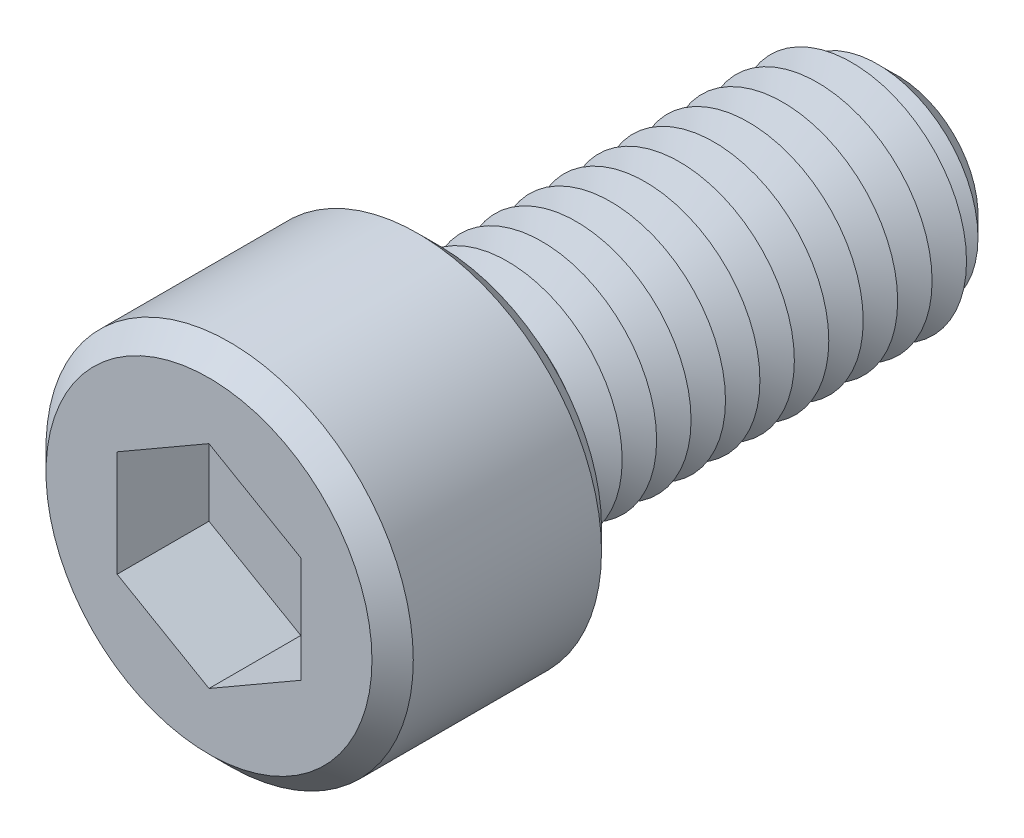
ISO-10303-21;
HEADER;
FILE_DESCRIPTION(('STEP AP214'),'2;1');
FILE_NAME('part.step','',(''),(''),'','','');
FILE_SCHEMA(('AUTOMOTIVE_DESIGN { 1 0 10303 214 1 1 1 1 }'));
ENDSEC;
DATA;
#1=APPLICATION_CONTEXT('core data for automotive mechanical design processes');
#2=APPLICATION_PROTOCOL_DEFINITION('international standard','automotive_design',2000,#1);
#3=PRODUCT_CONTEXT('',#1,'mechanical');
#4=PRODUCT('Part','Part','',(#3));
#5=PRODUCT_RELATED_PRODUCT_CATEGORY('part','',(#4));
#6=PRODUCT_DEFINITION_FORMATION('','',#4);
#7=PRODUCT_DEFINITION_CONTEXT('part definition',#1,'design');
#8=PRODUCT_DEFINITION('design','',#6,#7);
#9=PRODUCT_DEFINITION_SHAPE('','',#8);
#10=(LENGTH_UNIT() NAMED_UNIT(*) SI_UNIT(.MILLI.,.METRE.));
#11=(NAMED_UNIT(*) PLANE_ANGLE_UNIT() SI_UNIT($,.RADIAN.));
#12=(NAMED_UNIT(*) SI_UNIT($,.STERADIAN.) SOLID_ANGLE_UNIT());
#13=UNCERTAINTY_MEASURE_WITH_UNIT(LENGTH_MEASURE(1.E-05),#10,'distance_accuracy_value','');
#14=(GEOMETRIC_REPRESENTATION_CONTEXT(3) GLOBAL_UNCERTAINTY_ASSIGNED_CONTEXT((#13)) GLOBAL_UNIT_ASSIGNED_CONTEXT((#10,
#11,#12)) REPRESENTATION_CONTEXT('',''));
#15=CARTESIAN_POINT('',(0.,0.,0.));
#16=DIRECTION('',(0.,0.,1.));
#17=DIRECTION('',(1.,0.,0.));
#18=AXIS2_PLACEMENT_3D('',#15,#16,#17);
#19=CARTESIAN_POINT('',(0.,0.,10.));
#20=DIRECTION('',(0.,0.,-1.));
#21=DIRECTION('',(-1.,0.,0.));
#22=AXIS2_PLACEMENT_3D('',#19,#20,#21);
#23=CYLINDRICAL_SURFACE('',#22,8.);
#24=CARTESIAN_POINT('',(0.,0.,0.900000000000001));
#25=DIRECTION('',(0.,0.,1.));
#26=DIRECTION('',(1.,0.,0.));
#27=AXIS2_PLACEMENT_3D('',#24,#25,#26);
#28=CIRCLE('',#27,8.);
#29=CARTESIAN_POINT('',(8.,0.,0.900000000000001));
#30=VERTEX_POINT('',#29);
#31=EDGE_CURVE('E280',#30,#30,#28,.T.);
#32=ORIENTED_EDGE('',*,*,#31,.T.);
#33=EDGE_LOOP('',(#32));
#34=FACE_BOUND('',#33,.T.);
#35=CARTESIAN_POINT('',(0.,0.,9.1));
#36=DIRECTION('',(0.,0.,1.));
#37=DIRECTION('',(1.,0.,0.));
#38=AXIS2_PLACEMENT_3D('',#35,#36,#37);
#39=CIRCLE('',#38,8.);
#40=CARTESIAN_POINT('',(8.,0.,9.1));
#41=VERTEX_POINT('',#40);
#42=EDGE_CURVE('E274',#41,#41,#39,.F.);
#43=ORIENTED_EDGE('',*,*,#42,.T.);
#44=EDGE_LOOP('',(#43));
#45=FACE_BOUND('',#44,.T.);
#46=ADVANCED_FACE('F39',(#34,#45),#23,.T.);
#47=CARTESIAN_POINT('',(0.,0.,10.));
#48=DIRECTION('',(0.,0.,1.));
#49=DIRECTION('',(1.,0.,0.));
#50=AXIS2_PLACEMENT_3D('',#47,#48,#49);
#51=PLANE('',#50);
#52=CARTESIAN_POINT('',(0.,0.,10.));
#53=DIRECTION('',(0.,0.,1.));
#54=DIRECTION('',(1.,0.,0.));
#55=AXIS2_PLACEMENT_3D('',#52,#53,#54);
#56=CIRCLE('',#55,7.1);
#57=CARTESIAN_POINT('',(7.1,0.,10.));
#58=VERTEX_POINT('',#57);
#59=EDGE_CURVE('E11',#58,#58,#56,.T.);
#60=ORIENTED_EDGE('',*,*,#59,.T.);
#61=EDGE_LOOP('',(#60));
#62=FACE_BOUND('',#61,.T.);
#63=DIRECTION('',(-0.866025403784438,0.5,0.));
#64=VECTOR('',#63,1.);
#65=CARTESIAN_POINT('',(4.,2.3094010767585,10.));
#66=LINE('',#65,#64);
#67=CARTESIAN_POINT('',(4.,2.3094010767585,10.));
#68=VERTEX_POINT('',#67);
#69=CARTESIAN_POINT('',(0.,4.61880215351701,10.));
#70=VERTEX_POINT('',#69);
#71=EDGE_CURVE('E55',#68,#70,#66,.T.);
#72=ORIENTED_EDGE('',*,*,#71,.F.);
#73=DIRECTION('',(0.,1.,0.));
#74=VECTOR('',#73,1.);
#75=CARTESIAN_POINT('',(4.,-2.30940107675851,10.));
#76=LINE('',#75,#74);
#77=CARTESIAN_POINT('',(4.,-2.30940107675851,10.));
#78=VERTEX_POINT('',#77);
#79=EDGE_CURVE('E151',#78,#68,#76,.T.);
#80=ORIENTED_EDGE('',*,*,#79,.F.);
#81=DIRECTION('',(0.866025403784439,0.5,0.));
#82=VECTOR('',#81,1.);
#83=CARTESIAN_POINT('',(0.,-4.61880215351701,10.));
#84=LINE('',#83,#82);
#85=CARTESIAN_POINT('',(0.,-4.61880215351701,10.));
#86=VERTEX_POINT('',#85);
#87=EDGE_CURVE('E148',#86,#78,#84,.T.);
#88=ORIENTED_EDGE('',*,*,#87,.F.);
#89=DIRECTION('',(0.866025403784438,-0.5,0.));
#90=VECTOR('',#89,1.);
#91=CARTESIAN_POINT('',(-4.,-2.3094010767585,10.));
#92=LINE('',#91,#90);
#93=CARTESIAN_POINT('',(-4.,-2.3094010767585,10.));
#94=VERTEX_POINT('',#93);
#95=EDGE_CURVE('E103',#94,#86,#92,.T.);
#96=ORIENTED_EDGE('',*,*,#95,.F.);
#97=DIRECTION('',(0.,-1.,0.));
#98=VECTOR('',#97,1.);
#99=CARTESIAN_POINT('',(-4.,2.3094010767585,10.));
#100=LINE('',#99,#98);
#101=CARTESIAN_POINT('',(-4.,2.3094010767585,10.));
#102=VERTEX_POINT('',#101);
#103=EDGE_CURVE('E142',#102,#94,#100,.T.);
#104=ORIENTED_EDGE('',*,*,#103,.F.);
#105=DIRECTION('',(-0.866025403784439,-0.5,0.));
#106=VECTOR('',#105,1.);
#107=CARTESIAN_POINT('',(0.,4.61880215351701,10.));
#108=LINE('',#107,#106);
#109=EDGE_CURVE('E137',#70,#102,#108,.T.);
#110=ORIENTED_EDGE('',*,*,#109,.F.);
#111=EDGE_LOOP('',(#72,#80,#88,#96,#104,#110));
#112=FACE_BOUND('',#111,.T.);
#113=ADVANCED_FACE('F298',(#62,#112),#51,.T.);
#114=CARTESIAN_POINT('',(0.,0.,0.));
#115=DIRECTION('',(0.,0.,1.));
#116=DIRECTION('',(1.,0.,0.));
#117=AXIS2_PLACEMENT_3D('',#114,#115,#116);
#118=PLANE('',#117);
#119=CARTESIAN_POINT('',(0.,0.,0.));
#120=DIRECTION('',(0.,0.,1.));
#121=DIRECTION('',(1.,0.,0.));
#122=AXIS2_PLACEMENT_3D('',#119,#120,#121);
#123=CIRCLE('',#122,7.1);
#124=CARTESIAN_POINT('',(7.1,0.,0.));
#125=VERTEX_POINT('',#124);
#126=EDGE_CURVE('E48',#125,#125,#123,.F.);
#127=ORIENTED_EDGE('',*,*,#126,.T.);
#128=EDGE_LOOP('',(#127));
#129=FACE_BOUND('',#128,.T.);
#130=CARTESIAN_POINT('',(0.,0.,0.));
#131=DIRECTION('',(0.,0.,1.));
#132=DIRECTION('',(1.,0.,0.));
#133=AXIS2_PLACEMENT_3D('',#130,#131,#132);
#134=CIRCLE('',#133,5.);
#135=CARTESIAN_POINT('',(5.,0.,0.));
#136=VERTEX_POINT('',#135);
#137=EDGE_CURVE('E266',#136,#136,#134,.T.);
#138=ORIENTED_EDGE('',*,*,#137,.T.);
#139=EDGE_LOOP('',(#138));
#140=FACE_BOUND('',#139,.T.);
#141=ADVANCED_FACE('F287',(#129,#140),#118,.F.);
#142=CARTESIAN_POINT('',(0.,0.,0.));
#143=DIRECTION('',(0.,0.,1.));
#144=DIRECTION('',(1.,0.,0.));
#145=AXIS2_PLACEMENT_3D('',#142,#143,#144);
#146=CONICAL_SURFACE('',#145,5.,1.0471975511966);
#147=CARTESIAN_POINT('',(0.,0.,-0.750000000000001));
#148=DIRECTION('',(0.,0.,1.));
#149=DIRECTION('',(1.,0.,0.));
#150=AXIS2_PLACEMENT_3D('',#147,#148,#149);
#151=CIRCLE('',#150,3.70096189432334);
#152=CARTESIAN_POINT('',(3.70096189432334,0.,-0.750000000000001));
#153=VERTEX_POINT('',#152);
#154=EDGE_CURVE('E263',#153,#153,#151,.T.);
#155=ORIENTED_EDGE('',*,*,#154,.T.);
#156=EDGE_LOOP('',(#155));
#157=FACE_BOUND('',#156,.T.);
#158=ORIENTED_EDGE('',*,*,#137,.F.);
#159=EDGE_LOOP('',(#158));
#160=FACE_BOUND('',#159,.T.);
#161=ADVANCED_FACE('F452',(#157,#160),#146,.T.);
#162=CARTESIAN_POINT('',(0.,0.,-0.750000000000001));
#163=DIRECTION('',(0.,0.,-1.));
#164=DIRECTION('',(-1.,0.,0.));
#165=AXIS2_PLACEMENT_3D('',#162,#163,#164);
#166=CONICAL_SURFACE('',#165,3.70096189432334,1.0471975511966);
#167=CARTESIAN_POINT('',(0.,0.,-1.5));
#168=DIRECTION('',(0.,0.,1.));
#169=DIRECTION('',(1.,0.,0.));
#170=AXIS2_PLACEMENT_3D('',#167,#168,#169);
#171=CIRCLE('',#170,5.);
#172=CARTESIAN_POINT('',(5.,0.,-1.5));
#173=VERTEX_POINT('',#172);
#174=EDGE_CURVE('E259',#173,#173,#171,.T.);
#175=ORIENTED_EDGE('',*,*,#174,.T.);
#176=EDGE_LOOP('',(#175));
#177=FACE_BOUND('',#176,.T.);
#178=ORIENTED_EDGE('',*,*,#154,.F.);
#179=EDGE_LOOP('',(#178));
#180=FACE_BOUND('',#179,.T.);
#181=ADVANCED_FACE('F448',(#177,#180),#166,.T.);
#182=CARTESIAN_POINT('',(0.,0.,-1.5));
#183=DIRECTION('',(0.,0.,1.));
#184=DIRECTION('',(1.,0.,0.));
#185=AXIS2_PLACEMENT_3D('',#182,#183,#184);
#186=CONICAL_SURFACE('',#185,5.,1.0471975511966);
#187=CARTESIAN_POINT('',(0.,0.,-2.25));
#188=DIRECTION('',(0.,0.,1.));
#189=DIRECTION('',(1.,0.,0.));
#190=AXIS2_PLACEMENT_3D('',#187,#188,#189);
#191=CIRCLE('',#190,3.70096189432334);
#192=CARTESIAN_POINT('',(3.70096189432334,0.,-2.25));
#193=VERTEX_POINT('',#192);
#194=EDGE_CURVE('E255',#193,#193,#191,.T.);
#195=ORIENTED_EDGE('',*,*,#194,.T.);
#196=EDGE_LOOP('',(#195));
#197=FACE_BOUND('',#196,.T.);
#198=ORIENTED_EDGE('',*,*,#174,.F.);
#199=EDGE_LOOP('',(#198));
#200=FACE_BOUND('',#199,.T.);
#201=ADVANCED_FACE('F444',(#197,#200),#186,.T.);
#202=CARTESIAN_POINT('',(0.,0.,-2.25));
#203=DIRECTION('',(0.,0.,-1.));
#204=DIRECTION('',(-1.,0.,0.));
#205=AXIS2_PLACEMENT_3D('',#202,#203,#204);
#206=CONICAL_SURFACE('',#205,3.70096189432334,1.0471975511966);
#207=CARTESIAN_POINT('',(0.,0.,-3.));
#208=DIRECTION('',(0.,0.,1.));
#209=DIRECTION('',(1.,0.,0.));
#210=AXIS2_PLACEMENT_3D('',#207,#208,#209);
#211=CIRCLE('',#210,5.);
#212=CARTESIAN_POINT('',(5.,0.,-3.));
#213=VERTEX_POINT('',#212);
#214=EDGE_CURVE('E251',#213,#213,#211,.T.);
#215=ORIENTED_EDGE('',*,*,#214,.T.);
#216=EDGE_LOOP('',(#215));
#217=FACE_BOUND('',#216,.T.);
#218=ORIENTED_EDGE('',*,*,#194,.F.);
#219=EDGE_LOOP('',(#218));
#220=FACE_BOUND('',#219,.T.);
#221=ADVANCED_FACE('F440',(#217,#220),#206,.T.);
#222=CARTESIAN_POINT('',(0.,0.,-3.));
#223=DIRECTION('',(0.,0.,1.));
#224=DIRECTION('',(1.,0.,0.));
#225=AXIS2_PLACEMENT_3D('',#222,#223,#224);
#226=CONICAL_SURFACE('',#225,5.,1.0471975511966);
#227=CARTESIAN_POINT('',(0.,0.,-3.75));
#228=DIRECTION('',(0.,0.,1.));
#229=DIRECTION('',(1.,0.,0.));
#230=AXIS2_PLACEMENT_3D('',#227,#228,#229);
#231=CIRCLE('',#230,3.70096189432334);
#232=CARTESIAN_POINT('',(3.70096189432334,0.,-3.75));
#233=VERTEX_POINT('',#232);
#234=EDGE_CURVE('E247',#233,#233,#231,.T.);
#235=ORIENTED_EDGE('',*,*,#234,.T.);
#236=EDGE_LOOP('',(#235));
#237=FACE_BOUND('',#236,.T.);
#238=ORIENTED_EDGE('',*,*,#214,.F.);
#239=EDGE_LOOP('',(#238));
#240=FACE_BOUND('',#239,.T.);
#241=ADVANCED_FACE('F436',(#237,#240),#226,.T.);
#242=CARTESIAN_POINT('',(0.,0.,-3.75));
#243=DIRECTION('',(0.,0.,-1.));
#244=DIRECTION('',(-1.,0.,0.));
#245=AXIS2_PLACEMENT_3D('',#242,#243,#244);
#246=CONICAL_SURFACE('',#245,3.70096189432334,1.0471975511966);
#247=CARTESIAN_POINT('',(0.,0.,-4.5));
#248=DIRECTION('',(0.,0.,1.));
#249=DIRECTION('',(1.,0.,0.));
#250=AXIS2_PLACEMENT_3D('',#247,#248,#249);
#251=CIRCLE('',#250,5.);
#252=CARTESIAN_POINT('',(5.,0.,-4.5));
#253=VERTEX_POINT('',#252);
#254=EDGE_CURVE('E243',#253,#253,#251,.T.);
#255=ORIENTED_EDGE('',*,*,#254,.T.);
#256=EDGE_LOOP('',(#255));
#257=FACE_BOUND('',#256,.T.);
#258=ORIENTED_EDGE('',*,*,#234,.F.);
#259=EDGE_LOOP('',(#258));
#260=FACE_BOUND('',#259,.T.);
#261=ADVANCED_FACE('F432',(#257,#260),#246,.T.);
#262=CARTESIAN_POINT('',(0.,0.,-4.5));
#263=DIRECTION('',(0.,0.,1.));
#264=DIRECTION('',(1.,0.,0.));
#265=AXIS2_PLACEMENT_3D('',#262,#263,#264);
#266=CONICAL_SURFACE('',#265,5.,1.0471975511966);
#267=CARTESIAN_POINT('',(0.,0.,-5.25));
#268=DIRECTION('',(0.,0.,1.));
#269=DIRECTION('',(1.,0.,0.));
#270=AXIS2_PLACEMENT_3D('',#267,#268,#269);
#271=CIRCLE('',#270,3.70096189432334);
#272=CARTESIAN_POINT('',(3.70096189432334,0.,-5.25));
#273=VERTEX_POINT('',#272);
#274=EDGE_CURVE('E239',#273,#273,#271,.T.);
#275=ORIENTED_EDGE('',*,*,#274,.T.);
#276=EDGE_LOOP('',(#275));
#277=FACE_BOUND('',#276,.T.);
#278=ORIENTED_EDGE('',*,*,#254,.F.);
#279=EDGE_LOOP('',(#278));
#280=FACE_BOUND('',#279,.T.);
#281=ADVANCED_FACE('F428',(#277,#280),#266,.T.);
#282=CARTESIAN_POINT('',(0.,0.,-5.25));
#283=DIRECTION('',(0.,0.,-1.));
#284=DIRECTION('',(-1.,0.,0.));
#285=AXIS2_PLACEMENT_3D('',#282,#283,#284);
#286=CONICAL_SURFACE('',#285,3.70096189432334,1.0471975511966);
#287=CARTESIAN_POINT('',(0.,0.,-6.));
#288=DIRECTION('',(0.,0.,1.));
#289=DIRECTION('',(1.,0.,0.));
#290=AXIS2_PLACEMENT_3D('',#287,#288,#289);
#291=CIRCLE('',#290,5.);
#292=CARTESIAN_POINT('',(5.,0.,-6.));
#293=VERTEX_POINT('',#292);
#294=EDGE_CURVE('E235',#293,#293,#291,.T.);
#295=ORIENTED_EDGE('',*,*,#294,.T.);
#296=EDGE_LOOP('',(#295));
#297=FACE_BOUND('',#296,.T.);
#298=ORIENTED_EDGE('',*,*,#274,.F.);
#299=EDGE_LOOP('',(#298));
#300=FACE_BOUND('',#299,.T.);
#301=ADVANCED_FACE('F424',(#297,#300),#286,.T.);
#302=CARTESIAN_POINT('',(0.,0.,-6.));
#303=DIRECTION('',(0.,0.,1.));
#304=DIRECTION('',(1.,0.,0.));
#305=AXIS2_PLACEMENT_3D('',#302,#303,#304);
#306=CONICAL_SURFACE('',#305,5.,1.0471975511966);
#307=CARTESIAN_POINT('',(0.,0.,-6.75));
#308=DIRECTION('',(0.,0.,1.));
#309=DIRECTION('',(1.,0.,0.));
#310=AXIS2_PLACEMENT_3D('',#307,#308,#309);
#311=CIRCLE('',#310,3.70096189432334);
#312=CARTESIAN_POINT('',(3.70096189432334,0.,-6.75));
#313=VERTEX_POINT('',#312);
#314=EDGE_CURVE('E231',#313,#313,#311,.T.);
#315=ORIENTED_EDGE('',*,*,#314,.T.);
#316=EDGE_LOOP('',(#315));
#317=FACE_BOUND('',#316,.T.);
#318=ORIENTED_EDGE('',*,*,#294,.F.);
#319=EDGE_LOOP('',(#318));
#320=FACE_BOUND('',#319,.T.);
#321=ADVANCED_FACE('F420',(#317,#320),#306,.T.);
#322=CARTESIAN_POINT('',(0.,0.,-6.75));
#323=DIRECTION('',(0.,0.,-1.));
#324=DIRECTION('',(-1.,0.,0.));
#325=AXIS2_PLACEMENT_3D('',#322,#323,#324);
#326=CONICAL_SURFACE('',#325,3.70096189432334,1.0471975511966);
#327=CARTESIAN_POINT('',(0.,0.,-7.5));
#328=DIRECTION('',(0.,0.,1.));
#329=DIRECTION('',(1.,0.,0.));
#330=AXIS2_PLACEMENT_3D('',#327,#328,#329);
#331=CIRCLE('',#330,5.);
#332=CARTESIAN_POINT('',(5.,0.,-7.5));
#333=VERTEX_POINT('',#332);
#334=EDGE_CURVE('E227',#333,#333,#331,.T.);
#335=ORIENTED_EDGE('',*,*,#334,.T.);
#336=EDGE_LOOP('',(#335));
#337=FACE_BOUND('',#336,.T.);
#338=ORIENTED_EDGE('',*,*,#314,.F.);
#339=EDGE_LOOP('',(#338));
#340=FACE_BOUND('',#339,.T.);
#341=ADVANCED_FACE('F416',(#337,#340),#326,.T.);
#342=CARTESIAN_POINT('',(0.,0.,-7.5));
#343=DIRECTION('',(0.,0.,1.));
#344=DIRECTION('',(1.,0.,0.));
#345=AXIS2_PLACEMENT_3D('',#342,#343,#344);
#346=CONICAL_SURFACE('',#345,5.,1.0471975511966);
#347=CARTESIAN_POINT('',(0.,0.,-8.25));
#348=DIRECTION('',(0.,0.,1.));
#349=DIRECTION('',(1.,0.,0.));
#350=AXIS2_PLACEMENT_3D('',#347,#348,#349);
#351=CIRCLE('',#350,3.70096189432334);
#352=CARTESIAN_POINT('',(3.70096189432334,0.,-8.25));
#353=VERTEX_POINT('',#352);
#354=EDGE_CURVE('E223',#353,#353,#351,.T.);
#355=ORIENTED_EDGE('',*,*,#354,.T.);
#356=EDGE_LOOP('',(#355));
#357=FACE_BOUND('',#356,.T.);
#358=ORIENTED_EDGE('',*,*,#334,.F.);
#359=EDGE_LOOP('',(#358));
#360=FACE_BOUND('',#359,.T.);
#361=ADVANCED_FACE('F412',(#357,#360),#346,.T.);
#362=CARTESIAN_POINT('',(0.,0.,-8.25));
#363=DIRECTION('',(0.,0.,-1.));
#364=DIRECTION('',(-1.,0.,0.));
#365=AXIS2_PLACEMENT_3D('',#362,#363,#364);
#366=CONICAL_SURFACE('',#365,3.70096189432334,1.0471975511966);
#367=CARTESIAN_POINT('',(0.,0.,-9.));
#368=DIRECTION('',(0.,0.,1.));
#369=DIRECTION('',(1.,0.,0.));
#370=AXIS2_PLACEMENT_3D('',#367,#368,#369);
#371=CIRCLE('',#370,5.);
#372=CARTESIAN_POINT('',(5.,0.,-9.));
#373=VERTEX_POINT('',#372);
#374=EDGE_CURVE('E219',#373,#373,#371,.T.);
#375=ORIENTED_EDGE('',*,*,#374,.T.);
#376=EDGE_LOOP('',(#375));
#377=FACE_BOUND('',#376,.T.);
#378=ORIENTED_EDGE('',*,*,#354,.F.);
#379=EDGE_LOOP('',(#378));
#380=FACE_BOUND('',#379,.T.);
#381=ADVANCED_FACE('F408',(#377,#380),#366,.T.);
#382=CARTESIAN_POINT('',(0.,0.,-9.));
#383=DIRECTION('',(0.,0.,1.));
#384=DIRECTION('',(1.,0.,0.));
#385=AXIS2_PLACEMENT_3D('',#382,#383,#384);
#386=CONICAL_SURFACE('',#385,5.,1.0471975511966);
#387=CARTESIAN_POINT('',(0.,0.,-9.75));
#388=DIRECTION('',(0.,0.,1.));
#389=DIRECTION('',(1.,0.,0.));
#390=AXIS2_PLACEMENT_3D('',#387,#388,#389);
#391=CIRCLE('',#390,3.70096189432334);
#392=CARTESIAN_POINT('',(3.70096189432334,0.,-9.75));
#393=VERTEX_POINT('',#392);
#394=EDGE_CURVE('E215',#393,#393,#391,.T.);
#395=ORIENTED_EDGE('',*,*,#394,.T.);
#396=EDGE_LOOP('',(#395));
#397=FACE_BOUND('',#396,.T.);
#398=ORIENTED_EDGE('',*,*,#374,.F.);
#399=EDGE_LOOP('',(#398));
#400=FACE_BOUND('',#399,.T.);
#401=ADVANCED_FACE('F404',(#397,#400),#386,.T.);
#402=CARTESIAN_POINT('',(0.,0.,-9.75));
#403=DIRECTION('',(0.,0.,-1.));
#404=DIRECTION('',(-1.,0.,0.));
#405=AXIS2_PLACEMENT_3D('',#402,#403,#404);
#406=CONICAL_SURFACE('',#405,3.70096189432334,1.0471975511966);
#407=CARTESIAN_POINT('',(0.,0.,-10.5));
#408=DIRECTION('',(0.,0.,1.));
#409=DIRECTION('',(1.,0.,0.));
#410=AXIS2_PLACEMENT_3D('',#407,#408,#409);
#411=CIRCLE('',#410,5.);
#412=CARTESIAN_POINT('',(5.,0.,-10.5));
#413=VERTEX_POINT('',#412);
#414=EDGE_CURVE('E211',#413,#413,#411,.T.);
#415=ORIENTED_EDGE('',*,*,#414,.T.);
#416=EDGE_LOOP('',(#415));
#417=FACE_BOUND('',#416,.T.);
#418=ORIENTED_EDGE('',*,*,#394,.F.);
#419=EDGE_LOOP('',(#418));
#420=FACE_BOUND('',#419,.T.);
#421=ADVANCED_FACE('F400',(#417,#420),#406,.T.);
#422=CARTESIAN_POINT('',(0.,0.,-10.5));
#423=DIRECTION('',(0.,0.,1.));
#424=DIRECTION('',(1.,0.,0.));
#425=AXIS2_PLACEMENT_3D('',#422,#423,#424);
#426=CONICAL_SURFACE('',#425,5.,1.0471975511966);
#427=CARTESIAN_POINT('',(0.,0.,-11.25));
#428=DIRECTION('',(0.,0.,1.));
#429=DIRECTION('',(1.,0.,0.));
#430=AXIS2_PLACEMENT_3D('',#427,#428,#429);
#431=CIRCLE('',#430,3.70096189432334);
#432=CARTESIAN_POINT('',(3.70096189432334,0.,-11.25));
#433=VERTEX_POINT('',#432);
#434=EDGE_CURVE('E207',#433,#433,#431,.T.);
#435=ORIENTED_EDGE('',*,*,#434,.T.);
#436=EDGE_LOOP('',(#435));
#437=FACE_BOUND('',#436,.T.);
#438=ORIENTED_EDGE('',*,*,#414,.F.);
#439=EDGE_LOOP('',(#438));
#440=FACE_BOUND('',#439,.T.);
#441=ADVANCED_FACE('F396',(#437,#440),#426,.T.);
#442=CARTESIAN_POINT('',(0.,0.,-11.25));
#443=DIRECTION('',(0.,0.,-1.));
#444=DIRECTION('',(-1.,0.,0.));
#445=AXIS2_PLACEMENT_3D('',#442,#443,#444);
#446=CONICAL_SURFACE('',#445,3.70096189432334,1.0471975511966);
#447=CARTESIAN_POINT('',(0.,0.,-12.));
#448=DIRECTION('',(0.,0.,1.));
#449=DIRECTION('',(1.,0.,0.));
#450=AXIS2_PLACEMENT_3D('',#447,#448,#449);
#451=CIRCLE('',#450,5.);
#452=CARTESIAN_POINT('',(5.,0.,-12.));
#453=VERTEX_POINT('',#452);
#454=EDGE_CURVE('E203',#453,#453,#451,.T.);
#455=ORIENTED_EDGE('',*,*,#454,.T.);
#456=EDGE_LOOP('',(#455));
#457=FACE_BOUND('',#456,.T.);
#458=ORIENTED_EDGE('',*,*,#434,.F.);
#459=EDGE_LOOP('',(#458));
#460=FACE_BOUND('',#459,.T.);
#461=ADVANCED_FACE('F392',(#457,#460),#446,.T.);
#462=CARTESIAN_POINT('',(0.,0.,-12.));
#463=DIRECTION('',(0.,0.,1.));
#464=DIRECTION('',(1.,0.,0.));
#465=AXIS2_PLACEMENT_3D('',#462,#463,#464);
#466=CONICAL_SURFACE('',#465,5.,1.0471975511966);
#467=CARTESIAN_POINT('',(0.,0.,-12.75));
#468=DIRECTION('',(0.,0.,1.));
#469=DIRECTION('',(1.,0.,0.));
#470=AXIS2_PLACEMENT_3D('',#467,#468,#469);
#471=CIRCLE('',#470,3.70096189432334);
#472=CARTESIAN_POINT('',(3.70096189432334,0.,-12.75));
#473=VERTEX_POINT('',#472);
#474=EDGE_CURVE('E199',#473,#473,#471,.T.);
#475=ORIENTED_EDGE('',*,*,#474,.T.);
#476=EDGE_LOOP('',(#475));
#477=FACE_BOUND('',#476,.T.);
#478=ORIENTED_EDGE('',*,*,#454,.F.);
#479=EDGE_LOOP('',(#478));
#480=FACE_BOUND('',#479,.T.);
#481=ADVANCED_FACE('F388',(#477,#480),#466,.T.);
#482=CARTESIAN_POINT('',(0.,0.,-12.75));
#483=DIRECTION('',(0.,0.,-1.));
#484=DIRECTION('',(-1.,0.,0.));
#485=AXIS2_PLACEMENT_3D('',#482,#483,#484);
#486=CONICAL_SURFACE('',#485,3.70096189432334,1.0471975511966);
#487=CARTESIAN_POINT('',(0.,0.,-13.5));
#488=DIRECTION('',(0.,0.,1.));
#489=DIRECTION('',(1.,0.,0.));
#490=AXIS2_PLACEMENT_3D('',#487,#488,#489);
#491=CIRCLE('',#490,5.);
#492=CARTESIAN_POINT('',(5.,0.,-13.5));
#493=VERTEX_POINT('',#492);
#494=EDGE_CURVE('E195',#493,#493,#491,.T.);
#495=ORIENTED_EDGE('',*,*,#494,.T.);
#496=EDGE_LOOP('',(#495));
#497=FACE_BOUND('',#496,.T.);
#498=ORIENTED_EDGE('',*,*,#474,.F.);
#499=EDGE_LOOP('',(#498));
#500=FACE_BOUND('',#499,.T.);
#501=ADVANCED_FACE('F384',(#497,#500),#486,.T.);
#502=CARTESIAN_POINT('',(0.,0.,-13.5));
#503=DIRECTION('',(0.,0.,1.));
#504=DIRECTION('',(1.,0.,0.));
#505=AXIS2_PLACEMENT_3D('',#502,#503,#504);
#506=CONICAL_SURFACE('',#505,5.,1.0471975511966);
#507=CARTESIAN_POINT('',(0.,0.,-14.25));
#508=DIRECTION('',(0.,0.,1.));
#509=DIRECTION('',(1.,0.,0.));
#510=AXIS2_PLACEMENT_3D('',#507,#508,#509);
#511=CIRCLE('',#510,3.70096189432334);
#512=CARTESIAN_POINT('',(3.70096189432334,0.,-14.25));
#513=VERTEX_POINT('',#512);
#514=EDGE_CURVE('E191',#513,#513,#511,.T.);
#515=ORIENTED_EDGE('',*,*,#514,.T.);
#516=EDGE_LOOP('',(#515));
#517=FACE_BOUND('',#516,.T.);
#518=ORIENTED_EDGE('',*,*,#494,.F.);
#519=EDGE_LOOP('',(#518));
#520=FACE_BOUND('',#519,.T.);
#521=ADVANCED_FACE('F380',(#517,#520),#506,.T.);
#522=CARTESIAN_POINT('',(0.,0.,-14.25));
#523=DIRECTION('',(0.,0.,-1.));
#524=DIRECTION('',(-1.,0.,0.));
#525=AXIS2_PLACEMENT_3D('',#522,#523,#524);
#526=CONICAL_SURFACE('',#525,3.70096189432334,1.0471975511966);
#527=CARTESIAN_POINT('',(0.,0.,-15.));
#528=DIRECTION('',(0.,0.,1.));
#529=DIRECTION('',(1.,0.,0.));
#530=AXIS2_PLACEMENT_3D('',#527,#528,#529);
#531=CIRCLE('',#530,5.);
#532=CARTESIAN_POINT('',(5.,0.,-15.));
#533=VERTEX_POINT('',#532);
#534=EDGE_CURVE('E187',#533,#533,#531,.T.);
#535=ORIENTED_EDGE('',*,*,#534,.T.);
#536=EDGE_LOOP('',(#535));
#537=FACE_BOUND('',#536,.T.);
#538=ORIENTED_EDGE('',*,*,#514,.F.);
#539=EDGE_LOOP('',(#538));
#540=FACE_BOUND('',#539,.T.);
#541=ADVANCED_FACE('F376',(#537,#540),#526,.T.);
#542=CARTESIAN_POINT('',(0.,0.,-15.));
#543=DIRECTION('',(0.,0.,1.));
#544=DIRECTION('',(1.,0.,0.));
#545=AXIS2_PLACEMENT_3D('',#542,#543,#544);
#546=CONICAL_SURFACE('',#545,5.,1.0471975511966);
#547=CARTESIAN_POINT('',(0.,0.,-15.75));
#548=DIRECTION('',(0.,0.,1.));
#549=DIRECTION('',(1.,0.,0.));
#550=AXIS2_PLACEMENT_3D('',#547,#548,#549);
#551=CIRCLE('',#550,3.70096189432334);
#552=CARTESIAN_POINT('',(3.70096189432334,0.,-15.75));
#553=VERTEX_POINT('',#552);
#554=EDGE_CURVE('E183',#553,#553,#551,.T.);
#555=ORIENTED_EDGE('',*,*,#554,.T.);
#556=EDGE_LOOP('',(#555));
#557=FACE_BOUND('',#556,.T.);
#558=ORIENTED_EDGE('',*,*,#534,.F.);
#559=EDGE_LOOP('',(#558));
#560=FACE_BOUND('',#559,.T.);
#561=ADVANCED_FACE('F372',(#557,#560),#546,.T.);
#562=CARTESIAN_POINT('',(0.,0.,-15.75));
#563=DIRECTION('',(0.,0.,-1.));
#564=DIRECTION('',(-1.,0.,0.));
#565=AXIS2_PLACEMENT_3D('',#562,#563,#564);
#566=CONICAL_SURFACE('',#565,3.70096189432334,1.0471975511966);
#567=CARTESIAN_POINT('',(0.,0.,-16.5));
#568=DIRECTION('',(0.,0.,1.));
#569=DIRECTION('',(1.,0.,0.));
#570=AXIS2_PLACEMENT_3D('',#567,#568,#569);
#571=CIRCLE('',#570,5.);
#572=CARTESIAN_POINT('',(5.,0.,-16.5));
#573=VERTEX_POINT('',#572);
#574=EDGE_CURVE('E179',#573,#573,#571,.T.);
#575=ORIENTED_EDGE('',*,*,#574,.T.);
#576=EDGE_LOOP('',(#575));
#577=FACE_BOUND('',#576,.T.);
#578=ORIENTED_EDGE('',*,*,#554,.F.);
#579=EDGE_LOOP('',(#578));
#580=FACE_BOUND('',#579,.T.);
#581=ADVANCED_FACE('F368',(#577,#580),#566,.T.);
#582=CARTESIAN_POINT('',(0.,0.,-16.5));
#583=DIRECTION('',(0.,0.,1.));
#584=DIRECTION('',(1.,0.,0.));
#585=AXIS2_PLACEMENT_3D('',#582,#583,#584);
#586=CONICAL_SURFACE('',#585,5.,1.0471975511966);
#587=CARTESIAN_POINT('',(0.,0.,-17.25));
#588=DIRECTION('',(0.,0.,1.));
#589=DIRECTION('',(1.,0.,0.));
#590=AXIS2_PLACEMENT_3D('',#587,#588,#589);
#591=CIRCLE('',#590,3.70096189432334);
#592=CARTESIAN_POINT('',(3.70096189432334,0.,-17.25));
#593=VERTEX_POINT('',#592);
#594=EDGE_CURVE('E175',#593,#593,#591,.T.);
#595=ORIENTED_EDGE('',*,*,#594,.T.);
#596=EDGE_LOOP('',(#595));
#597=FACE_BOUND('',#596,.T.);
#598=ORIENTED_EDGE('',*,*,#574,.F.);
#599=EDGE_LOOP('',(#598));
#600=FACE_BOUND('',#599,.T.);
#601=ADVANCED_FACE('F364',(#597,#600),#586,.T.);
#602=CARTESIAN_POINT('',(0.,0.,-17.25));
#603=DIRECTION('',(0.,0.,-1.));
#604=DIRECTION('',(-1.,0.,0.));
#605=AXIS2_PLACEMENT_3D('',#602,#603,#604);
#606=CONICAL_SURFACE('',#605,3.70096189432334,1.0471975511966);
#607=CARTESIAN_POINT('',(0.,0.,-18.));
#608=DIRECTION('',(0.,0.,1.));
#609=DIRECTION('',(1.,0.,0.));
#610=AXIS2_PLACEMENT_3D('',#607,#608,#609);
#611=CIRCLE('',#610,5.);
#612=CARTESIAN_POINT('',(5.,0.,-18.));
#613=VERTEX_POINT('',#612);
#614=EDGE_CURVE('E170',#613,#613,#611,.T.);
#615=ORIENTED_EDGE('',*,*,#614,.T.);
#616=EDGE_LOOP('',(#615));
#617=FACE_BOUND('',#616,.T.);
#618=ORIENTED_EDGE('',*,*,#594,.F.);
#619=EDGE_LOOP('',(#618));
#620=FACE_BOUND('',#619,.T.);
#621=ADVANCED_FACE('F360',(#617,#620),#606,.T.);
#622=CARTESIAN_POINT('',(0.,0.,-18.));
#623=DIRECTION('',(0.,0.,1.));
#624=DIRECTION('',(1.,0.,0.));
#625=AXIS2_PLACEMENT_3D('',#622,#623,#624);
#626=CONICAL_SURFACE('',#625,5.,1.0471975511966);
#627=CARTESIAN_POINT('',(0.,0.,-18.75));
#628=DIRECTION('',(0.,0.,1.));
#629=DIRECTION('',(1.,0.,0.));
#630=AXIS2_PLACEMENT_3D('',#627,#628,#629);
#631=CIRCLE('',#630,3.70096189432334);
#632=CARTESIAN_POINT('',(3.70096189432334,0.,-18.75));
#633=VERTEX_POINT('',#632);
#634=EDGE_CURVE('E157',#633,#633,#631,.T.);
#635=ORIENTED_EDGE('',*,*,#634,.T.);
#636=EDGE_LOOP('',(#635));
#637=FACE_BOUND('',#636,.T.);
#638=ORIENTED_EDGE('',*,*,#614,.F.);
#639=EDGE_LOOP('',(#638));
#640=FACE_BOUND('',#639,.T.);
#641=ADVANCED_FACE('F356',(#637,#640),#626,.T.);
#642=CARTESIAN_POINT('',(0.,0.,-18.75));
#643=DIRECTION('',(0.,0.,-1.));
#644=DIRECTION('',(-1.,0.,0.));
#645=AXIS2_PLACEMENT_3D('',#642,#643,#644);
#646=CONICAL_SURFACE('',#645,3.70096189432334,1.0471975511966);
#647=CARTESIAN_POINT('',(0.,0.,-19.1339745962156));
#648=DIRECTION('',(0.,0.,-1.));
#649=DIRECTION('',(-1.,0.,0.));
#650=AXIS2_PLACEMENT_3D('',#647,#648,#649);
#651=CIRCLE('',#650,4.36602540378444);
#652=CARTESIAN_POINT('',(-4.36602540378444,0.,-19.1339745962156));
#653=VERTEX_POINT('',#652);
#654=EDGE_CURVE('E174',#653,#653,#651,.T.);
#655=ORIENTED_EDGE('',*,*,#654,.F.);
#656=EDGE_LOOP('',(#655));
#657=FACE_BOUND('',#656,.T.);
#658=ORIENTED_EDGE('',*,*,#634,.F.);
#659=EDGE_LOOP('',(#658));
#660=FACE_BOUND('',#659,.T.);
#661=ADVANCED_FACE('F352',(#657,#660),#646,.T.);
#662=CARTESIAN_POINT('',(0.,0.,-20.));
#663=DIRECTION('',(0.,0.,-1.));
#664=DIRECTION('',(-1.,0.,0.));
#665=AXIS2_PLACEMENT_3D('',#662,#663,#664);
#666=PLANE('',#665);
#667=CARTESIAN_POINT('',(0.,0.,-20.));
#668=DIRECTION('',(0.,0.,-1.));
#669=DIRECTION('',(-1.,0.,0.));
#670=AXIS2_PLACEMENT_3D('',#667,#668,#669);
#671=CIRCLE('',#670,0.9);
#672=CARTESIAN_POINT('',(-0.9,0.,-20.));
#673=VERTEX_POINT('',#672);
#674=EDGE_CURVE('E138',#673,#673,#671,.F.);
#675=ORIENTED_EDGE('',*,*,#674,.T.);
#676=EDGE_LOOP('',(#675));
#677=FACE_BOUND('',#676,.T.);
#678=CARTESIAN_POINT('',(0.,0.,-20.));
#679=DIRECTION('',(0.,0.,-1.));
#680=DIRECTION('',(-1.,0.,0.));
#681=AXIS2_PLACEMENT_3D('',#678,#679,#680);
#682=CIRCLE('',#681,3.50000000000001);
#683=CARTESIAN_POINT('',(-3.50000000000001,0.,-20.));
#684=VERTEX_POINT('',#683);
#685=EDGE_CURVE('E270',#684,#684,#682,.T.);
#686=ORIENTED_EDGE('',*,*,#685,.T.);
#687=EDGE_LOOP('',(#686));
#688=FACE_BOUND('',#687,.T.);
#689=ADVANCED_FACE('F355',(#677,#688),#666,.T.);
#690=CARTESIAN_POINT('',(0.,0.,-20.));
#691=DIRECTION('',(0.,0.,1.));
#692=DIRECTION('',(1.,0.,0.));
#693=AXIS2_PLACEMENT_3D('',#690,#691,#692);
#694=CONICAL_SURFACE('',#693,3.50000000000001,0.785398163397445);
#695=ORIENTED_EDGE('',*,*,#685,.F.);
#696=EDGE_LOOP('',(#695));
#697=FACE_BOUND('',#696,.T.);
#698=ORIENTED_EDGE('',*,*,#654,.T.);
#699=EDGE_LOOP('',(#698));
#700=FACE_BOUND('',#699,.T.);
#701=ADVANCED_FACE('F351',(#697,#700),#694,.T.);
#702=CARTESIAN_POINT('',(4.,2.3094010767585,6.));
#703=DIRECTION('',(0.5,0.866025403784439,0.));
#704=DIRECTION('',(-0.866025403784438,0.5,0.));
#705=AXIS2_PLACEMENT_3D('',#702,#703,#704);
#706=PLANE('',#705);
#707=ORIENTED_EDGE('',*,*,#71,.T.);
#708=DIRECTION('',(0.,0.,1.));
#709=VECTOR('',#708,1.);
#710=CARTESIAN_POINT('',(0.,4.61880215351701,6.));
#711=LINE('',#710,#709);
#712=CARTESIAN_POINT('',(0.,4.61880215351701,6.));
#713=VERTEX_POINT('',#712);
#714=EDGE_CURVE('E85',#713,#70,#711,.T.);
#715=ORIENTED_EDGE('',*,*,#714,.F.);
#716=DIRECTION('',(-0.866025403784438,0.5,0.));
#717=VECTOR('',#716,1.);
#718=CARTESIAN_POINT('',(4.,2.3094010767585,6.));
#719=LINE('',#718,#717);
#720=CARTESIAN_POINT('',(4.,2.3094010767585,6.));
#721=VERTEX_POINT('',#720);
#722=EDGE_CURVE('E154',#721,#713,#719,.T.);
#723=ORIENTED_EDGE('',*,*,#722,.F.);
#724=DIRECTION('',(0.,0.,1.));
#725=VECTOR('',#724,1.);
#726=CARTESIAN_POINT('',(4.,2.3094010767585,6.));
#727=LINE('',#726,#725);
#728=EDGE_CURVE('E63',#721,#68,#727,.T.);
#729=ORIENTED_EDGE('',*,*,#728,.T.);
#730=EDGE_LOOP('',(#707,#715,#723,#729));
#731=FACE_BOUND('',#730,.T.);
#732=ADVANCED_FACE('F341',(#731),#706,.F.);
#733=CARTESIAN_POINT('',(4.,-2.30940107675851,6.));
#734=DIRECTION('',(1.,0.,0.));
#735=DIRECTION('',(0.,0.,-1.));
#736=AXIS2_PLACEMENT_3D('',#733,#734,#735);
#737=PLANE('',#736);
#738=ORIENTED_EDGE('',*,*,#79,.T.);
#739=ORIENTED_EDGE('',*,*,#728,.F.);
#740=DIRECTION('',(0.,1.,0.));
#741=VECTOR('',#740,1.);
#742=CARTESIAN_POINT('',(4.,-2.30940107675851,6.));
#743=LINE('',#742,#741);
#744=CARTESIAN_POINT('',(4.,-2.30940107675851,6.));
#745=VERTEX_POINT('',#744);
#746=EDGE_CURVE('E117',#745,#721,#743,.T.);
#747=ORIENTED_EDGE('',*,*,#746,.F.);
#748=DIRECTION('',(0.,0.,1.));
#749=VECTOR('',#748,1.);
#750=CARTESIAN_POINT('',(4.,-2.30940107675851,6.));
#751=LINE('',#750,#749);
#752=EDGE_CURVE('E108',#745,#78,#751,.T.);
#753=ORIENTED_EDGE('',*,*,#752,.T.);
#754=EDGE_LOOP('',(#738,#739,#747,#753));
#755=FACE_BOUND('',#754,.T.);
#756=ADVANCED_FACE('F338',(#755),#737,.F.);
#757=CARTESIAN_POINT('',(0.,-4.61880215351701,6.));
#758=DIRECTION('',(0.5,-0.866025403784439,0.));
#759=DIRECTION('',(0.866025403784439,0.5,0.));
#760=AXIS2_PLACEMENT_3D('',#757,#758,#759);
#761=PLANE('',#760);
#762=ORIENTED_EDGE('',*,*,#87,.T.);
#763=ORIENTED_EDGE('',*,*,#752,.F.);
#764=DIRECTION('',(0.866025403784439,0.5,0.));
#765=VECTOR('',#764,1.);
#766=CARTESIAN_POINT('',(0.,-4.61880215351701,6.));
#767=LINE('',#766,#765);
#768=CARTESIAN_POINT('',(0.,-4.61880215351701,6.));
#769=VERTEX_POINT('',#768);
#770=EDGE_CURVE('E112',#769,#745,#767,.T.);
#771=ORIENTED_EDGE('',*,*,#770,.F.);
#772=DIRECTION('',(0.,0.,1.));
#773=VECTOR('',#772,1.);
#774=CARTESIAN_POINT('',(0.,-4.61880215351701,6.));
#775=LINE('',#774,#773);
#776=EDGE_CURVE('E96',#769,#86,#775,.T.);
#777=ORIENTED_EDGE('',*,*,#776,.T.);
#778=EDGE_LOOP('',(#762,#763,#771,#777));
#779=FACE_BOUND('',#778,.T.);
#780=ADVANCED_FACE('F113',(#779),#761,.F.);
#781=CARTESIAN_POINT('',(-4.,-2.3094010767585,6.));
#782=DIRECTION('',(-0.5,-0.866025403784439,0.));
#783=DIRECTION('',(0.866025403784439,-0.5,0.));
#784=AXIS2_PLACEMENT_3D('',#781,#782,#783);
#785=PLANE('',#784);
#786=ORIENTED_EDGE('',*,*,#95,.T.);
#787=ORIENTED_EDGE('',*,*,#776,.F.);
#788=DIRECTION('',(0.866025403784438,-0.5,0.));
#789=VECTOR('',#788,1.);
#790=CARTESIAN_POINT('',(-4.,-2.3094010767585,6.));
#791=LINE('',#790,#789);
#792=CARTESIAN_POINT('',(-4.,-2.3094010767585,6.));
#793=VERTEX_POINT('',#792);
#794=EDGE_CURVE('E100',#793,#769,#791,.T.);
#795=ORIENTED_EDGE('',*,*,#794,.F.);
#796=DIRECTION('',(0.,0.,1.));
#797=VECTOR('',#796,1.);
#798=CARTESIAN_POINT('',(-4.,-2.3094010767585,6.));
#799=LINE('',#798,#797);
#800=EDGE_CURVE('E109',#793,#94,#799,.T.);
#801=ORIENTED_EDGE('',*,*,#800,.T.);
#802=EDGE_LOOP('',(#786,#787,#795,#801));
#803=FACE_BOUND('',#802,.T.);
#804=ADVANCED_FACE('F98',(#803),#785,.F.);
#805=CARTESIAN_POINT('',(-4.,2.3094010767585,6.));
#806=DIRECTION('',(-1.,0.,0.));
#807=DIRECTION('',(0.,-1.,0.));
#808=AXIS2_PLACEMENT_3D('',#805,#806,#807);
#809=PLANE('',#808);
#810=ORIENTED_EDGE('',*,*,#103,.T.);
#811=ORIENTED_EDGE('',*,*,#800,.F.);
#812=DIRECTION('',(0.,-1.,0.));
#813=VECTOR('',#812,1.);
#814=CARTESIAN_POINT('',(-4.,2.3094010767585,6.));
#815=LINE('',#814,#813);
#816=CARTESIAN_POINT('',(-4.,2.3094010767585,6.));
#817=VERTEX_POINT('',#816);
#818=EDGE_CURVE('E123',#817,#793,#815,.T.);
#819=ORIENTED_EDGE('',*,*,#818,.F.);
#820=DIRECTION('',(0.,0.,1.));
#821=VECTOR('',#820,1.);
#822=CARTESIAN_POINT('',(-4.,2.3094010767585,6.));
#823=LINE('',#822,#821);
#824=EDGE_CURVE('E162',#817,#102,#823,.T.);
#825=ORIENTED_EDGE('',*,*,#824,.T.);
#826=EDGE_LOOP('',(#810,#811,#819,#825));
#827=FACE_BOUND('',#826,.T.);
#828=ADVANCED_FACE('F335',(#827),#809,.F.);
#829=CARTESIAN_POINT('',(0.,4.61880215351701,6.));
#830=DIRECTION('',(-0.5,0.866025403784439,0.));
#831=DIRECTION('',(-0.866025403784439,-0.5,0.));
#832=AXIS2_PLACEMENT_3D('',#829,#830,#831);
#833=PLANE('',#832);
#834=ORIENTED_EDGE('',*,*,#109,.T.);
#835=ORIENTED_EDGE('',*,*,#824,.F.);
#836=DIRECTION('',(-0.866025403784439,-0.5,0.));
#837=VECTOR('',#836,1.);
#838=CARTESIAN_POINT('',(0.,4.61880215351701,6.));
#839=LINE('',#838,#837);
#840=EDGE_CURVE('E129',#713,#817,#839,.T.);
#841=ORIENTED_EDGE('',*,*,#840,.F.);
#842=ORIENTED_EDGE('',*,*,#714,.T.);
#843=EDGE_LOOP('',(#834,#835,#841,#842));
#844=FACE_BOUND('',#843,.T.);
#845=ADVANCED_FACE('F313',(#844),#833,.F.);
#846=CARTESIAN_POINT('',(0.,0.,6.));
#847=DIRECTION('',(0.,0.,1.));
#848=DIRECTION('',(1.,0.,0.));
#849=AXIS2_PLACEMENT_3D('',#846,#847,#848);
#850=PLANE('',#849);
#851=CARTESIAN_POINT('',(0.,0.,6.));
#852=DIRECTION('',(0.,0.,1.));
#853=DIRECTION('',(1.,0.,0.));
#854=AXIS2_PLACEMENT_3D('',#851,#852,#853);
#855=CIRCLE('',#854,0.9);
#856=CARTESIAN_POINT('',(0.9,0.,6.));
#857=VERTEX_POINT('',#856);
#858=EDGE_CURVE('E321',#857,#857,#855,.T.);
#859=ORIENTED_EDGE('',*,*,#858,.F.);
#860=EDGE_LOOP('',(#859));
#861=FACE_BOUND('',#860,.T.);
#862=ORIENTED_EDGE('',*,*,#722,.T.);
#863=ORIENTED_EDGE('',*,*,#840,.T.);
#864=ORIENTED_EDGE('',*,*,#818,.T.);
#865=ORIENTED_EDGE('',*,*,#794,.T.);
#866=ORIENTED_EDGE('',*,*,#770,.T.);
#867=ORIENTED_EDGE('',*,*,#746,.T.);
#868=EDGE_LOOP('',(#862,#863,#864,#865,#866,#867));
#869=FACE_BOUND('',#868,.T.);
#870=ADVANCED_FACE('F120',(#861,#869),#850,.T.);
#871=CARTESIAN_POINT('',(0.,0.,-22.5455844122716));
#872=DIRECTION('',(0.,0.,1.));
#873=DIRECTION('',(1.,0.,0.));
#874=AXIS2_PLACEMENT_3D('',#871,#872,#873);
#875=CYLINDRICAL_SURFACE('',#874,0.9);
#876=ORIENTED_EDGE('',*,*,#858,.T.);
#877=EDGE_LOOP('',(#876));
#878=FACE_BOUND('',#877,.T.);
#879=ORIENTED_EDGE('',*,*,#674,.F.);
#880=EDGE_LOOP('',(#879));
#881=FACE_BOUND('',#880,.T.);
#882=ADVANCED_FACE('F293',(#878,#881),#875,.F.);
#883=CARTESIAN_POINT('',(0.,0.,0.900000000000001));
#884=DIRECTION('',(0.,0.,1.));
#885=DIRECTION('',(1.,0.,0.));
#886=AXIS2_PLACEMENT_3D('',#883,#884,#885);
#887=CONICAL_SURFACE('',#886,8.,0.78539816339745);
#888=ORIENTED_EDGE('',*,*,#126,.F.);
#889=EDGE_LOOP('',(#888));
#890=FACE_BOUND('',#889,.T.);
#891=ORIENTED_EDGE('',*,*,#31,.F.);
#892=EDGE_LOOP('',(#891));
#893=FACE_BOUND('',#892,.T.);
#894=ADVANCED_FACE('F290',(#890,#893),#887,.T.);
#895=CARTESIAN_POINT('',(0.,0.,10.));
#896=DIRECTION('',(0.,0.,-1.));
#897=DIRECTION('',(-1.,0.,0.));
#898=AXIS2_PLACEMENT_3D('',#895,#896,#897);
#899=CONICAL_SURFACE('',#898,7.1,0.785398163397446);
#900=ORIENTED_EDGE('',*,*,#42,.F.);
#901=EDGE_LOOP('',(#900));
#902=FACE_BOUND('',#901,.T.);
#903=ORIENTED_EDGE('',*,*,#59,.F.);
#904=EDGE_LOOP('',(#903));
#905=FACE_BOUND('',#904,.T.);
#906=ADVANCED_FACE('F41',(#902,#905),#899,.T.);
#907=CLOSED_SHELL('',(#46,#113,#141,#161,#181,#201,#221,#241,#261,#281,#301,#321,#341,#361,#381,
#401,#421,#441,#461,#481,#501,#521,#541,#561,#581,#601,#621,#641,#661,#689,#701,#732,#756,#780,
#804,#828,#845,#870,#882,#894,#906));
#908=MANIFOLD_SOLID_BREP('B2',#907);
#909=ADVANCED_BREP_SHAPE_REPRESENTATION('',(#18,#908),#14);
#910=SHAPE_DEFINITION_REPRESENTATION(#9,#909);
ENDSEC;
END-ISO-10303-21;
